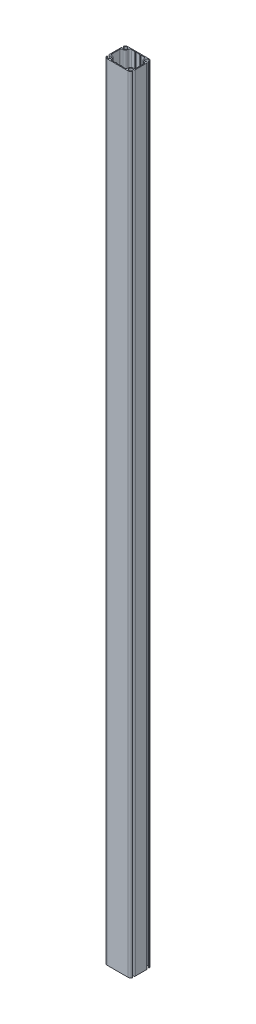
from build123d import *

# Parameters (mm, degrees)
SALIENTE_EXTRUIR2_DEPTH = 3000


with BuildPart() as part:
    # Croquis2 → Saliente-Extruir2 (new body)
    with BuildSketch(Plane(origin=(0, 0, 0), x_dir=(1, 0, 0), z_dir=(0, 1, 0))):
        with BuildLine():
            Line((40.5, 40), (-40.5, 40))
            ThreePointArc((-40.5, 40), (-46.389741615, 37.953921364), (-49.742457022, 32.69704078))
            ThreePointArc((-49.742457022, 32.69704078), (-48.630022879, 30.890804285), (-46.823786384, 32.003238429))
            ThreePointArc((-46.823786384, 32.003238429), (-34.495655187, 32.989546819), (-43.904761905, 24.96306977))
            ThreePointArc((-43.904761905, 24.96306977), (-47.951800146, 25.047214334), (-50, 21.55572809))
            Line((-50, 21.55572809), (-50, -21.55572809))
            ThreePointArc((-50, -21.55572809), (-47.951800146, -25.047214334), (-43.904761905, -24.96306977))
            ThreePointArc((-43.904761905, -24.96306977), (-34.495655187, -32.989546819), (-46.823786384, -32.003238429))
            ThreePointArc((-46.823786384, -32.003238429), (-48.630022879, -30.890804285), (-49.742457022, -32.69704078))
            ThreePointArc((-49.742457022, -32.69704078), (-46.389741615, -37.953921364), (-40.5, -40))
            Line((-40.5, -40), (40.5, -40))
            ThreePointArc((40.5, -40), (46.389741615, -37.953921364), (49.742457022, -32.69704078))
            ThreePointArc((49.742457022, -32.69704078), (48.630022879, -30.890804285), (46.823786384, -32.003238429))
            ThreePointArc((46.823786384, -32.003238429), (34.495655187, -32.989546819), (43.904761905, -24.96306977))
            ThreePointArc((43.904761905, -24.96306977), (47.951800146, -25.047214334), (50, -21.55572809))
            Line((50, -21.55572809), (50, 21.55572809))
            ThreePointArc((50, 21.55572809), (47.951800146, 25.047214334), (43.904761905, 24.96306977))
            ThreePointArc((43.904761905, 24.96306977), (34.495655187, 32.989546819), (46.823786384, 32.003238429))
            ThreePointArc((46.823786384, 32.003238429), (48.630022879, 30.890804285), (49.742457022, 32.69704078))
            ThreePointArc((49.742457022, 32.69704078), (46.389741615, 37.953921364), (40.5, 40))
        make_face()
        with BuildLine():
            Line((-11, 35.5), (-8, 35.5))
            Line((-8, 35.5), (-6.5, 37))
            Line((-6.5, 37), (6.5, 37))
            Line((6.5, 37), (8, 35.5))
            Line((8, 35.5), (11, 35.5))
            Line((11, 35.5), (12.5, 37))
            Line((12.5, 37), (24.5, 37))
            ThreePointArc((24.5, 37), (29.096194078, 35.096194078), (31, 30.5))
            ThreePointArc((31, 30.5), (33.782485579, 23.782485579), (40.5, 21))
            ThreePointArc((40.5, 21), (45.096194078, 19.096194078), (47, 14.5))
            Line((47, 14.5), (47, -14.5))
            ThreePointArc((47, -14.5), (45.096194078, -19.096194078), (40.5, -21))
            ThreePointArc((40.5, -21), (33.782485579, -23.782485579), (31, -30.5))
            ThreePointArc((31, -30.5), (29.096194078, -35.096194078), (24.5, -37))
            Line((24.5, -37), (12.5, -37))
            Line((12.5, -37), (11, -35.5))
            Line((11, -35.5), (8, -35.5))
            Line((8, -35.5), (6.5, -37))
            Line((6.5, -37), (-6.5, -37))
            Line((-6.5, -37), (-8, -35.5))
            Line((-8, -35.5), (-11, -35.5))
            Line((-11, -35.5), (-12.5, -37))
            Line((-12.5, -37), (-24.5, -37))
            ThreePointArc((-24.5, -37), (-29.096194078, -35.096194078), (-31, -30.5))
            ThreePointArc((-31, -30.5), (-33.782485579, -23.782485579), (-40.5, -21))
            ThreePointArc((-40.5, -21), (-45.096194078, -19.096194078), (-47, -14.5))
            Line((-47, -14.5), (-47, 14.5))
            ThreePointArc((-47, 14.5), (-45.096194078, 19.096194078), (-40.5, 21))
            ThreePointArc((-40.5, 21), (-33.782485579, 23.782485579), (-31, 30.5))
            ThreePointArc((-31, 30.5), (-29.096194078, 35.096194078), (-24.5, 37))
            Line((-24.5, 37), (-12.5, 37))
            Line((-12.5, 37), (-11, 35.5))
        make_face(mode=Mode.SUBTRACT)
    extrude(amount=SALIENTE_EXTRUIR2_DEPTH)


solid = part.part
